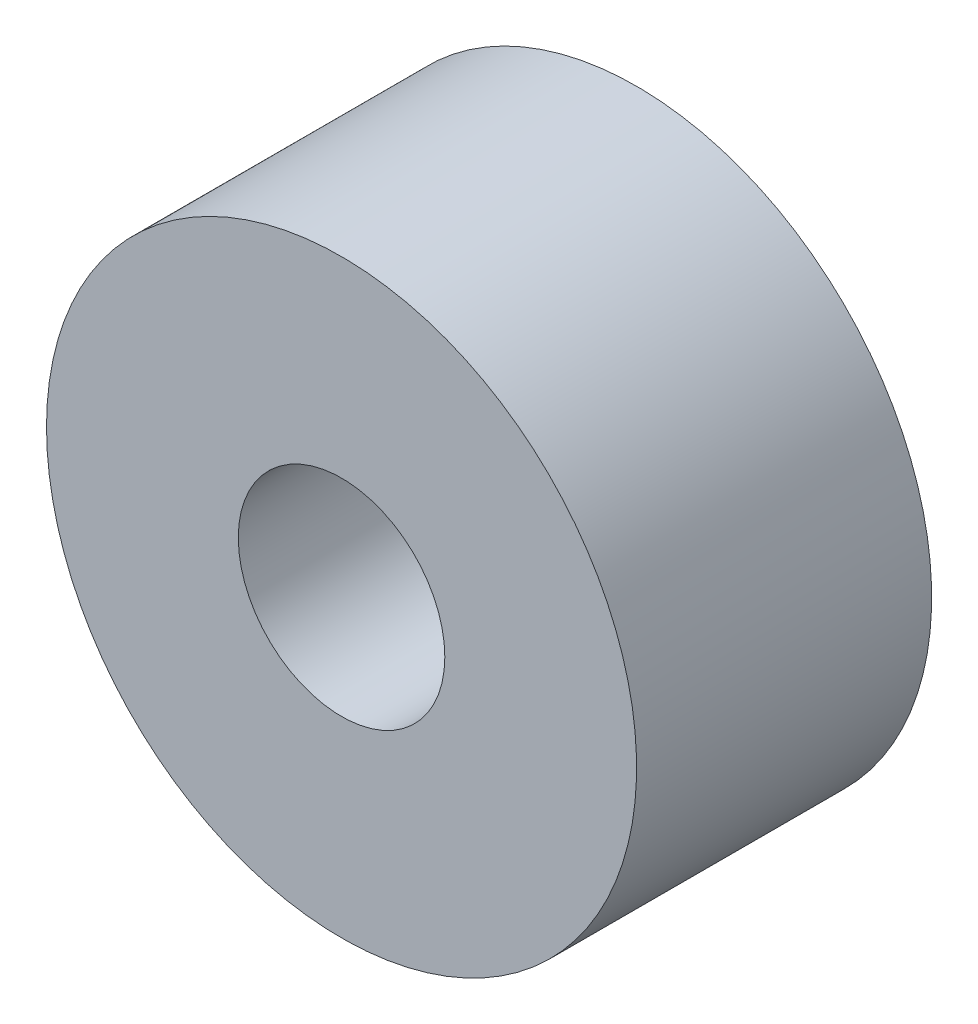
from build123d import *

# Parameters (mm, degrees)
BODYFV_W   = 15
BODYFV_H   = 15
THRUHLFV_W = 5.25
THRUHLFV_H = 15


with BuildPart() as part:
    # BodyFV → Revolve1 (revolve)
    with BuildSketch(Plane(origin=(0, 0, 0), x_dir=(1, 0, 0), z_dir=(0, 1, 0)), mode=Mode.PRIVATE) as revolve1_sk:
        with Locations((7.5, 7.5)):
            Rectangle(BODYFV_W, BODYFV_H)
    revolve(revolve1_sk.sketch.rotate(Axis((0, 0, 0), (0, 0, 1)), 180), axis=Axis((0, 0, 0), (0, 0, 1)))

    # ThruHlFV → Thru Hole (revolve, cut)
    with BuildSketch(Plane(origin=(0, 0, 0), x_dir=(1, 0, 0), z_dir=(0, 1, 0)), mode=Mode.PRIVATE) as thru_hole_sk:
        with Locations((2.625, 7.5)):
            Rectangle(THRUHLFV_W, THRUHLFV_H)
    revolve(thru_hole_sk.sketch.rotate(Axis((0, 0, 0), (0, 0, 1)), 180), axis=Axis((0, 0, 0), (0, 0, 1)), mode=Mode.SUBTRACT)


solid = part.part
